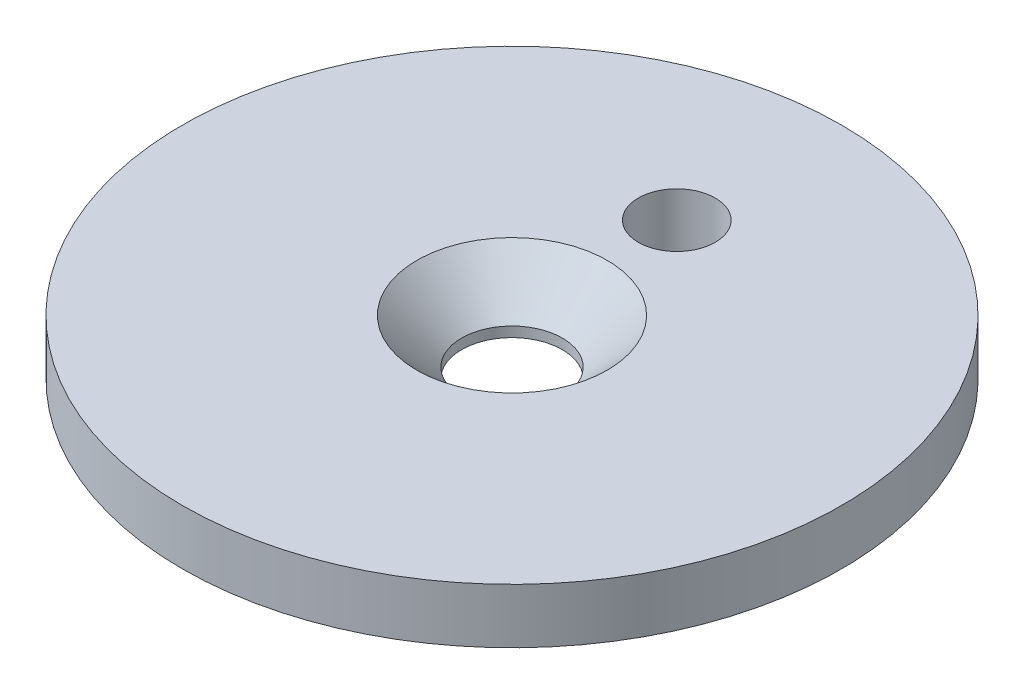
ISO-10303-21;
HEADER;
FILE_DESCRIPTION(('STEP AP214'),'2;1');
FILE_NAME('part.step','',(''),(''),'','','');
FILE_SCHEMA(('AUTOMOTIVE_DESIGN { 1 0 10303 214 1 1 1 1 }'));
ENDSEC;
DATA;
#1=APPLICATION_CONTEXT('core data for automotive mechanical design processes');
#2=APPLICATION_PROTOCOL_DEFINITION('international standard','automotive_design',2000,#1);
#3=PRODUCT_CONTEXT('',#1,'mechanical');
#4=PRODUCT('Part','Part','',(#3));
#5=PRODUCT_RELATED_PRODUCT_CATEGORY('part','',(#4));
#6=PRODUCT_DEFINITION_FORMATION('','',#4);
#7=PRODUCT_DEFINITION_CONTEXT('part definition',#1,'design');
#8=PRODUCT_DEFINITION('design','',#6,#7);
#9=PRODUCT_DEFINITION_SHAPE('','',#8);
#10=(LENGTH_UNIT() NAMED_UNIT(*) SI_UNIT(.MILLI.,.METRE.));
#11=(NAMED_UNIT(*) PLANE_ANGLE_UNIT() SI_UNIT($,.RADIAN.));
#12=(NAMED_UNIT(*) SI_UNIT($,.STERADIAN.) SOLID_ANGLE_UNIT());
#13=UNCERTAINTY_MEASURE_WITH_UNIT(LENGTH_MEASURE(1.E-05),#10,'distance_accuracy_value','');
#14=(GEOMETRIC_REPRESENTATION_CONTEXT(3) GLOBAL_UNCERTAINTY_ASSIGNED_CONTEXT((#13)) GLOBAL_UNIT_ASSIGNED_CONTEXT((#10,
#11,#12)) REPRESENTATION_CONTEXT('',''));
#15=CARTESIAN_POINT('',(0.,0.,0.));
#16=DIRECTION('',(0.,0.,1.));
#17=DIRECTION('',(1.,0.,0.));
#18=AXIS2_PLACEMENT_3D('',#15,#16,#17);
#19=CARTESIAN_POINT('',(0.,3.,0.));
#20=DIRECTION('',(0.,-1.,0.));
#21=DIRECTION('',(0.,0.,-1.));
#22=AXIS2_PLACEMENT_3D('',#19,#20,#21);
#23=CYLINDRICAL_SURFACE('',#22,18.);
#24=CARTESIAN_POINT('',(0.,3.,0.));
#25=DIRECTION('',(0.,1.,0.));
#26=DIRECTION('',(0.,0.,1.));
#27=AXIS2_PLACEMENT_3D('',#24,#25,#26);
#28=CIRCLE('',#27,18.);
#29=CARTESIAN_POINT('',(0.,3.,18.));
#30=VERTEX_POINT('',#29);
#31=EDGE_CURVE('E10',#30,#30,#28,.T.);
#32=ORIENTED_EDGE('',*,*,#31,.F.);
#33=EDGE_LOOP('',(#32));
#34=FACE_BOUND('',#33,.T.);
#35=CARTESIAN_POINT('',(0.,0.,0.));
#36=DIRECTION('',(0.,1.,0.));
#37=DIRECTION('',(0.,0.,1.));
#38=AXIS2_PLACEMENT_3D('',#35,#36,#37);
#39=CIRCLE('',#38,18.);
#40=CARTESIAN_POINT('',(0.,0.,18.));
#41=VERTEX_POINT('',#40);
#42=EDGE_CURVE('E32',#41,#41,#39,.T.);
#43=ORIENTED_EDGE('',*,*,#42,.T.);
#44=EDGE_LOOP('',(#43));
#45=FACE_BOUND('',#44,.T.);
#46=ADVANCED_FACE('F29',(#34,#45),#23,.T.);
#47=CARTESIAN_POINT('',(0.,3.,0.));
#48=DIRECTION('',(0.,1.,0.));
#49=DIRECTION('',(0.,0.,1.));
#50=AXIS2_PLACEMENT_3D('',#47,#48,#49);
#51=PLANE('',#50);
#52=CARTESIAN_POINT('',(0.,3.,0.));
#53=DIRECTION('',(0.,1.,0.));
#54=DIRECTION('',(0.,0.,1.));
#55=AXIS2_PLACEMENT_3D('',#52,#53,#54);
#56=CIRCLE('',#55,5.2);
#57=CARTESIAN_POINT('',(0.,3.,5.2));
#58=VERTEX_POINT('',#57);
#59=EDGE_CURVE('E52',#58,#58,#56,.T.);
#60=ORIENTED_EDGE('',*,*,#59,.F.);
#61=EDGE_LOOP('',(#60));
#62=FACE_BOUND('',#61,.T.);
#63=CARTESIAN_POINT('',(0.,3.,-9.));
#64=DIRECTION('',(0.,1.,0.));
#65=DIRECTION('',(0.,0.,1.));
#66=AXIS2_PLACEMENT_3D('',#63,#64,#65);
#67=CIRCLE('',#66,2.09999999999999);
#68=CARTESIAN_POINT('',(0.,3.,-6.90000000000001));
#69=VERTEX_POINT('',#68);
#70=EDGE_CURVE('E43',#69,#69,#67,.T.);
#71=ORIENTED_EDGE('',*,*,#70,.F.);
#72=EDGE_LOOP('',(#71));
#73=FACE_BOUND('',#72,.T.);
#74=ORIENTED_EDGE('',*,*,#31,.T.);
#75=EDGE_LOOP('',(#74));
#76=FACE_BOUND('',#75,.T.);
#77=ADVANCED_FACE('F58',(#62,#73,#76),#51,.T.);
#78=CARTESIAN_POINT('',(0.,0.,0.));
#79=DIRECTION('',(0.,1.,0.));
#80=DIRECTION('',(0.,0.,1.));
#81=AXIS2_PLACEMENT_3D('',#78,#79,#80);
#82=PLANE('',#81);
#83=CARTESIAN_POINT('',(0.,0.,0.));
#84=DIRECTION('',(0.,1.,0.));
#85=DIRECTION('',(0.,0.,1.));
#86=AXIS2_PLACEMENT_3D('',#83,#84,#85);
#87=CIRCLE('',#86,2.75);
#88=CARTESIAN_POINT('',(0.,0.,2.75));
#89=VERTEX_POINT('',#88);
#90=EDGE_CURVE('E46',#89,#89,#87,.T.);
#91=ORIENTED_EDGE('',*,*,#90,.T.);
#92=EDGE_LOOP('',(#91));
#93=FACE_BOUND('',#92,.T.);
#94=CARTESIAN_POINT('',(0.,0.,-9.));
#95=DIRECTION('',(0.,1.,0.));
#96=DIRECTION('',(0.,0.,1.));
#97=AXIS2_PLACEMENT_3D('',#94,#95,#96);
#98=CIRCLE('',#97,2.1);
#99=CARTESIAN_POINT('',(0.,0.,-6.9));
#100=VERTEX_POINT('',#99);
#101=EDGE_CURVE('E39',#100,#100,#98,.T.);
#102=ORIENTED_EDGE('',*,*,#101,.T.);
#103=EDGE_LOOP('',(#102));
#104=FACE_BOUND('',#103,.T.);
#105=ORIENTED_EDGE('',*,*,#42,.F.);
#106=EDGE_LOOP('',(#105));
#107=FACE_BOUND('',#106,.T.);
#108=ADVANCED_FACE('F61',(#93,#104,#107),#82,.F.);
#109=CARTESIAN_POINT('',(0.,3.,-9.));
#110=DIRECTION('',(0.,1.,0.));
#111=DIRECTION('',(0.,0.,1.));
#112=AXIS2_PLACEMENT_3D('',#109,#110,#111);
#113=CYLINDRICAL_SURFACE('',#112,2.09999999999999);
#114=ORIENTED_EDGE('',*,*,#101,.F.);
#115=EDGE_LOOP('',(#114));
#116=FACE_BOUND('',#115,.T.);
#117=ORIENTED_EDGE('',*,*,#70,.T.);
#118=EDGE_LOOP('',(#117));
#119=FACE_BOUND('',#118,.T.);
#120=ADVANCED_FACE('F65',(#116,#119),#113,.F.);
#121=CARTESIAN_POINT('',(0.,3.,0.));
#122=DIRECTION('',(0.,1.,0.));
#123=DIRECTION('',(0.,0.,1.));
#124=AXIS2_PLACEMENT_3D('',#121,#122,#123);
#125=CYLINDRICAL_SURFACE('',#124,2.75);
#126=ORIENTED_EDGE('',*,*,#90,.F.);
#127=EDGE_LOOP('',(#126));
#128=FACE_BOUND('',#127,.T.);
#129=CARTESIAN_POINT('',(0.,0.549999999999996,0.));
#130=DIRECTION('',(0.,1.,0.));
#131=DIRECTION('',(0.,0.,1.));
#132=AXIS2_PLACEMENT_3D('',#129,#130,#131);
#133=CIRCLE('',#132,2.75);
#134=CARTESIAN_POINT('',(0.,0.549999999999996,2.75));
#135=VERTEX_POINT('',#134);
#136=EDGE_CURVE('E49',#135,#135,#133,.T.);
#137=ORIENTED_EDGE('',*,*,#136,.T.);
#138=EDGE_LOOP('',(#137));
#139=FACE_BOUND('',#138,.T.);
#140=ADVANCED_FACE('F67',(#128,#139),#125,.F.);
#141=CARTESIAN_POINT('',(0.,3.,0.));
#142=DIRECTION('',(0.,1.,0.));
#143=DIRECTION('',(0.,0.,1.));
#144=AXIS2_PLACEMENT_3D('',#141,#142,#143);
#145=CONICAL_SURFACE('',#144,5.2,0.785398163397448);
#146=ORIENTED_EDGE('',*,*,#136,.F.);
#147=EDGE_LOOP('',(#146));
#148=FACE_BOUND('',#147,.T.);
#149=ORIENTED_EDGE('',*,*,#59,.T.);
#150=EDGE_LOOP('',(#149));
#151=FACE_BOUND('',#150,.T.);
#152=ADVANCED_FACE('F56',(#148,#151),#145,.F.);
#153=CLOSED_SHELL('',(#46,#77,#108,#120,#140,#152));
#154=MANIFOLD_SOLID_BREP('B2',#153);
#155=ADVANCED_BREP_SHAPE_REPRESENTATION('',(#18,#154),#14);
#156=SHAPE_DEFINITION_REPRESENTATION(#9,#155);
ENDSEC;
END-ISO-10303-21;
